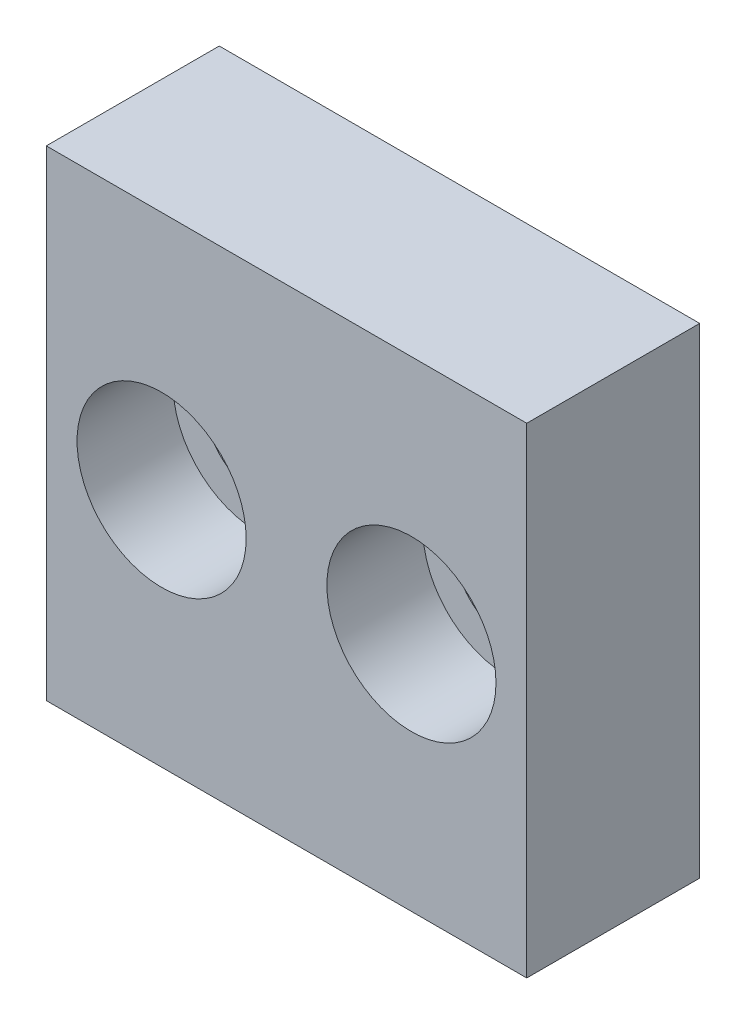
ISO-10303-21;
HEADER;
FILE_DESCRIPTION(('STEP AP214'),'2;1');
FILE_NAME('part.step','',(''),(''),'','','');
FILE_SCHEMA(('AUTOMOTIVE_DESIGN { 1 0 10303 214 1 1 1 1 }'));
ENDSEC;
DATA;
#1=APPLICATION_CONTEXT('core data for automotive mechanical design processes');
#2=APPLICATION_PROTOCOL_DEFINITION('international standard','automotive_design',2000,#1);
#3=PRODUCT_CONTEXT('',#1,'mechanical');
#4=PRODUCT('Part','Part','',(#3));
#5=PRODUCT_RELATED_PRODUCT_CATEGORY('part','',(#4));
#6=PRODUCT_DEFINITION_FORMATION('','',#4);
#7=PRODUCT_DEFINITION_CONTEXT('part definition',#1,'design');
#8=PRODUCT_DEFINITION('design','',#6,#7);
#9=PRODUCT_DEFINITION_SHAPE('','',#8);
#10=(LENGTH_UNIT() NAMED_UNIT(*) SI_UNIT(.MILLI.,.METRE.));
#11=(NAMED_UNIT(*) PLANE_ANGLE_UNIT() SI_UNIT($,.RADIAN.));
#12=(NAMED_UNIT(*) SI_UNIT($,.STERADIAN.) SOLID_ANGLE_UNIT());
#13=UNCERTAINTY_MEASURE_WITH_UNIT(LENGTH_MEASURE(1.E-05),#10,'distance_accuracy_value','');
#14=(GEOMETRIC_REPRESENTATION_CONTEXT(3) GLOBAL_UNCERTAINTY_ASSIGNED_CONTEXT((#13)) GLOBAL_UNIT_ASSIGNED_CONTEXT((#10,
#11,#12)) REPRESENTATION_CONTEXT('',''));
#15=CARTESIAN_POINT('',(0.,0.,0.));
#16=DIRECTION('',(0.,0.,1.));
#17=DIRECTION('',(1.,0.,0.));
#18=AXIS2_PLACEMENT_3D('',#15,#16,#17);
#19=CARTESIAN_POINT('',(-12.,25.,18.));
#20=DIRECTION('',(1.,0.,0.));
#21=DIRECTION('',(0.,1.,0.));
#22=AXIS2_PLACEMENT_3D('',#19,#20,#21);
#23=PLANE('',#22);
#24=DIRECTION('',(0.,-1.,0.));
#25=VECTOR('',#24,1.);
#26=CARTESIAN_POINT('',(-12.,25.,0.));
#27=LINE('',#26,#25);
#28=CARTESIAN_POINT('',(-12.,25.,0.));
#29=VERTEX_POINT('',#28);
#30=CARTESIAN_POINT('',(-12.,-25.,0.));
#31=VERTEX_POINT('',#30);
#32=EDGE_CURVE('E58',#29,#31,#27,.T.);
#33=ORIENTED_EDGE('',*,*,#32,.T.);
#34=DIRECTION('',(0.,0.,-1.));
#35=VECTOR('',#34,1.);
#36=CARTESIAN_POINT('',(-12.,-25.,18.));
#37=LINE('',#36,#35);
#38=CARTESIAN_POINT('',(-12.,-25.,18.));
#39=VERTEX_POINT('',#38);
#40=EDGE_CURVE('E9',#39,#31,#37,.T.);
#41=ORIENTED_EDGE('',*,*,#40,.F.);
#42=DIRECTION('',(0.,-1.,0.));
#43=VECTOR('',#42,1.);
#44=CARTESIAN_POINT('',(-12.,25.,18.));
#45=LINE('',#44,#43);
#46=CARTESIAN_POINT('',(-12.,25.,18.));
#47=VERTEX_POINT('',#46);
#48=EDGE_CURVE('E81',#47,#39,#45,.T.);
#49=ORIENTED_EDGE('',*,*,#48,.F.);
#50=DIRECTION('',(0.,0.,-1.));
#51=VECTOR('',#50,1.);
#52=CARTESIAN_POINT('',(-12.,25.,18.));
#53=LINE('',#52,#51);
#54=EDGE_CURVE('E70',#47,#29,#53,.T.);
#55=ORIENTED_EDGE('',*,*,#54,.T.);
#56=EDGE_LOOP('',(#33,#41,#49,#55));
#57=FACE_BOUND('',#56,.T.);
#58=ADVANCED_FACE('F14',(#57),#23,.F.);
#59=CARTESIAN_POINT('',(-12.,-25.,18.));
#60=DIRECTION('',(0.,1.,0.));
#61=DIRECTION('',(-1.,0.,0.));
#62=AXIS2_PLACEMENT_3D('',#59,#60,#61);
#63=PLANE('',#62);
#64=DIRECTION('',(1.,0.,0.));
#65=VECTOR('',#64,1.);
#66=CARTESIAN_POINT('',(-12.,-25.,0.));
#67=LINE('',#66,#65);
#68=CARTESIAN_POINT('',(38.,-25.,0.));
#69=VERTEX_POINT('',#68);
#70=EDGE_CURVE('E54',#31,#69,#67,.T.);
#71=ORIENTED_EDGE('',*,*,#70,.T.);
#72=DIRECTION('',(0.,0.,-1.));
#73=VECTOR('',#72,1.);
#74=CARTESIAN_POINT('',(38.,-25.,18.));
#75=LINE('',#74,#73);
#76=CARTESIAN_POINT('',(38.,-25.,18.));
#77=VERTEX_POINT('',#76);
#78=EDGE_CURVE('E21',#77,#69,#75,.T.);
#79=ORIENTED_EDGE('',*,*,#78,.F.);
#80=DIRECTION('',(1.,0.,0.));
#81=VECTOR('',#80,1.);
#82=CARTESIAN_POINT('',(-12.,-25.,18.));
#83=LINE('',#82,#81);
#84=EDGE_CURVE('E66',#39,#77,#83,.T.);
#85=ORIENTED_EDGE('',*,*,#84,.F.);
#86=ORIENTED_EDGE('',*,*,#40,.T.);
#87=EDGE_LOOP('',(#71,#79,#85,#86));
#88=FACE_BOUND('',#87,.T.);
#89=ADVANCED_FACE('F65',(#88),#63,.F.);
#90=CARTESIAN_POINT('',(38.,25.,18.));
#91=DIRECTION('',(-1.,0.,0.));
#92=DIRECTION('',(0.,-1.,0.));
#93=AXIS2_PLACEMENT_3D('',#90,#91,#92);
#94=PLANE('',#93);
#95=DIRECTION('',(0.,1.,0.));
#96=VECTOR('',#95,1.);
#97=CARTESIAN_POINT('',(38.,25.,0.));
#98=LINE('',#97,#96);
#99=CARTESIAN_POINT('',(38.,25.,0.));
#100=VERTEX_POINT('',#99);
#101=EDGE_CURVE('E59',#69,#100,#98,.T.);
#102=ORIENTED_EDGE('',*,*,#101,.T.);
#103=DIRECTION('',(0.,0.,-1.));
#104=VECTOR('',#103,1.);
#105=CARTESIAN_POINT('',(38.,25.,18.));
#106=LINE('',#105,#104);
#107=CARTESIAN_POINT('',(38.,25.,18.));
#108=VERTEX_POINT('',#107);
#109=EDGE_CURVE('E87',#108,#100,#106,.T.);
#110=ORIENTED_EDGE('',*,*,#109,.F.);
#111=DIRECTION('',(0.,1.,0.));
#112=VECTOR('',#111,1.);
#113=CARTESIAN_POINT('',(38.,25.,18.));
#114=LINE('',#113,#112);
#115=EDGE_CURVE('E33',#77,#108,#114,.T.);
#116=ORIENTED_EDGE('',*,*,#115,.F.);
#117=ORIENTED_EDGE('',*,*,#78,.T.);
#118=EDGE_LOOP('',(#102,#110,#116,#117));
#119=FACE_BOUND('',#118,.T.);
#120=ADVANCED_FACE('F90',(#119),#94,.F.);
#121=CARTESIAN_POINT('',(-12.,25.,18.));
#122=DIRECTION('',(0.,-1.,0.));
#123=DIRECTION('',(0.,0.,-1.));
#124=AXIS2_PLACEMENT_3D('',#121,#122,#123);
#125=PLANE('',#124);
#126=DIRECTION('',(-1.,0.,0.));
#127=VECTOR('',#126,1.);
#128=CARTESIAN_POINT('',(-12.,25.,0.));
#129=LINE('',#128,#127);
#130=EDGE_CURVE('E79',#100,#29,#129,.T.);
#131=ORIENTED_EDGE('',*,*,#130,.T.);
#132=ORIENTED_EDGE('',*,*,#54,.F.);
#133=DIRECTION('',(-1.,0.,0.));
#134=VECTOR('',#133,1.);
#135=CARTESIAN_POINT('',(-12.,25.,18.));
#136=LINE('',#135,#134);
#137=EDGE_CURVE('E28',#108,#47,#136,.T.);
#138=ORIENTED_EDGE('',*,*,#137,.F.);
#139=ORIENTED_EDGE('',*,*,#109,.T.);
#140=EDGE_LOOP('',(#131,#132,#138,#139));
#141=FACE_BOUND('',#140,.T.);
#142=ADVANCED_FACE('F92',(#141),#125,.F.);
#143=CARTESIAN_POINT('',(-12.,-25.,18.));
#144=DIRECTION('',(0.,0.,1.));
#145=DIRECTION('',(1.,0.,0.));
#146=AXIS2_PLACEMENT_3D('',#143,#144,#145);
#147=PLANE('',#146);
#148=CARTESIAN_POINT('',(26.,0.,18.));
#149=DIRECTION('',(0.,0.,1.));
#150=DIRECTION('',(1.,0.,0.));
#151=AXIS2_PLACEMENT_3D('',#148,#149,#150);
#152=CIRCLE('',#151,8.8);
#153=CARTESIAN_POINT('',(34.8,0.,18.));
#154=VERTEX_POINT('',#153);
#155=EDGE_CURVE('E222',#154,#154,#152,.T.);
#156=ORIENTED_EDGE('',*,*,#155,.F.);
#157=EDGE_LOOP('',(#156));
#158=FACE_BOUND('',#157,.T.);
#159=CARTESIAN_POINT('',(0.,0.,18.));
#160=DIRECTION('',(0.,0.,1.));
#161=DIRECTION('',(1.,0.,0.));
#162=AXIS2_PLACEMENT_3D('',#159,#160,#161);
#163=CIRCLE('',#162,8.8);
#164=CARTESIAN_POINT('',(8.79999999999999,0.,18.));
#165=VERTEX_POINT('',#164);
#166=EDGE_CURVE('E71',#165,#165,#163,.T.);
#167=ORIENTED_EDGE('',*,*,#166,.F.);
#168=EDGE_LOOP('',(#167));
#169=FACE_BOUND('',#168,.T.);
#170=ORIENTED_EDGE('',*,*,#48,.T.);
#171=ORIENTED_EDGE('',*,*,#84,.T.);
#172=ORIENTED_EDGE('',*,*,#115,.T.);
#173=ORIENTED_EDGE('',*,*,#137,.T.);
#174=EDGE_LOOP('',(#170,#171,#172,#173));
#175=FACE_BOUND('',#174,.T.);
#176=ADVANCED_FACE('F93',(#158,#169,#175),#147,.T.);
#177=CARTESIAN_POINT('',(-12.,-25.,0.));
#178=DIRECTION('',(0.,0.,1.));
#179=DIRECTION('',(1.,0.,0.));
#180=AXIS2_PLACEMENT_3D('',#177,#178,#179);
#181=PLANE('',#180);
#182=CARTESIAN_POINT('',(26.,0.,1.41425066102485E-10));
#183=DIRECTION('',(0.,0.,1.));
#184=DIRECTION('',(1.,0.,0.));
#185=AXIS2_PLACEMENT_3D('',#182,#183,#184);
#186=CIRCLE('',#185,5.5);
#187=CARTESIAN_POINT('',(31.5,0.,1.41425066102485E-10));
#188=VERTEX_POINT('',#187);
#189=EDGE_CURVE('E215',#188,#188,#186,.T.);
#190=ORIENTED_EDGE('',*,*,#189,.T.);
#191=EDGE_LOOP('',(#190));
#192=FACE_BOUND('',#191,.T.);
#193=CARTESIAN_POINT('',(0.,0.,1.41425066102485E-10));
#194=DIRECTION('',(0.,0.,1.));
#195=DIRECTION('',(1.,0.,0.));
#196=AXIS2_PLACEMENT_3D('',#193,#194,#195);
#197=CIRCLE('',#196,5.5);
#198=CARTESIAN_POINT('',(5.49999999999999,0.,1.41425066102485E-10));
#199=VERTEX_POINT('',#198);
#200=EDGE_CURVE('E228',#199,#199,#197,.T.);
#201=ORIENTED_EDGE('',*,*,#200,.T.);
#202=EDGE_LOOP('',(#201));
#203=FACE_BOUND('',#202,.T.);
#204=ORIENTED_EDGE('',*,*,#32,.F.);
#205=ORIENTED_EDGE('',*,*,#130,.F.);
#206=ORIENTED_EDGE('',*,*,#101,.F.);
#207=ORIENTED_EDGE('',*,*,#70,.F.);
#208=EDGE_LOOP('',(#204,#205,#206,#207));
#209=FACE_BOUND('',#208,.T.);
#210=ADVANCED_FACE('F55',(#192,#203,#209),#181,.F.);
#211=CARTESIAN_POINT('',(0.,0.,18.));
#212=DIRECTION('',(0.,0.,1.));
#213=DIRECTION('',(1.,0.,0.));
#214=AXIS2_PLACEMENT_3D('',#211,#212,#213);
#215=CYLINDRICAL_SURFACE('',#214,8.8);
#216=CARTESIAN_POINT('',(0.,0.,8.));
#217=DIRECTION('',(0.,0.,1.));
#218=DIRECTION('',(1.,0.,0.));
#219=AXIS2_PLACEMENT_3D('',#216,#217,#218);
#220=CIRCLE('',#219,8.8);
#221=CARTESIAN_POINT('',(8.79999999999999,0.,8.));
#222=VERTEX_POINT('',#221);
#223=EDGE_CURVE('E74',#222,#222,#220,.T.);
#224=ORIENTED_EDGE('',*,*,#223,.F.);
#225=EDGE_LOOP('',(#224));
#226=FACE_BOUND('',#225,.T.);
#227=ORIENTED_EDGE('',*,*,#166,.T.);
#228=EDGE_LOOP('',(#227));
#229=FACE_BOUND('',#228,.T.);
#230=ADVANCED_FACE('F103',(#226,#229),#215,.F.);
#231=CARTESIAN_POINT('',(5.5,0.,8.));
#232=DIRECTION('',(0.,0.,-1.));
#233=DIRECTION('',(-1.,0.,0.));
#234=AXIS2_PLACEMENT_3D('',#231,#232,#233);
#235=PLANE('',#234);
#236=CARTESIAN_POINT('',(0.,0.,8.));
#237=DIRECTION('',(0.,0.,1.));
#238=DIRECTION('',(1.,0.,0.));
#239=AXIS2_PLACEMENT_3D('',#236,#237,#238);
#240=CIRCLE('',#239,5.5);
#241=CARTESIAN_POINT('',(5.49999999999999,0.,8.));
#242=VERTEX_POINT('',#241);
#243=EDGE_CURVE('E231',#242,#242,#240,.T.);
#244=ORIENTED_EDGE('',*,*,#243,.F.);
#245=EDGE_LOOP('',(#244));
#246=FACE_BOUND('',#245,.T.);
#247=ORIENTED_EDGE('',*,*,#223,.T.);
#248=EDGE_LOOP('',(#247));
#249=FACE_BOUND('',#248,.T.);
#250=ADVANCED_FACE('F159',(#246,#249),#235,.F.);
#251=CARTESIAN_POINT('',(0.,0.,18.));
#252=DIRECTION('',(0.,0.,1.));
#253=DIRECTION('',(1.,0.,0.));
#254=AXIS2_PLACEMENT_3D('',#251,#252,#253);
#255=CYLINDRICAL_SURFACE('',#254,5.5);
#256=ORIENTED_EDGE('',*,*,#200,.F.);
#257=EDGE_LOOP('',(#256));
#258=FACE_BOUND('',#257,.T.);
#259=ORIENTED_EDGE('',*,*,#243,.T.);
#260=EDGE_LOOP('',(#259));
#261=FACE_BOUND('',#260,.T.);
#262=ADVANCED_FACE('F167',(#258,#261),#255,.F.);
#263=CARTESIAN_POINT('',(26.,0.,18.));
#264=DIRECTION('',(0.,0.,1.));
#265=DIRECTION('',(1.,0.,0.));
#266=AXIS2_PLACEMENT_3D('',#263,#264,#265);
#267=CYLINDRICAL_SURFACE('',#266,8.8);
#268=CARTESIAN_POINT('',(26.,0.,8.));
#269=DIRECTION('',(0.,0.,1.));
#270=DIRECTION('',(1.,0.,0.));
#271=AXIS2_PLACEMENT_3D('',#268,#269,#270);
#272=CIRCLE('',#271,8.8);
#273=CARTESIAN_POINT('',(34.8,0.,8.));
#274=VERTEX_POINT('',#273);
#275=EDGE_CURVE('E219',#274,#274,#272,.T.);
#276=ORIENTED_EDGE('',*,*,#275,.F.);
#277=EDGE_LOOP('',(#276));
#278=FACE_BOUND('',#277,.T.);
#279=ORIENTED_EDGE('',*,*,#155,.T.);
#280=EDGE_LOOP('',(#279));
#281=FACE_BOUND('',#280,.T.);
#282=ADVANCED_FACE('F176',(#278,#281),#267,.F.);
#283=CARTESIAN_POINT('',(31.5,0.,8.));
#284=DIRECTION('',(0.,0.,-1.));
#285=DIRECTION('',(-1.,0.,0.));
#286=AXIS2_PLACEMENT_3D('',#283,#284,#285);
#287=PLANE('',#286);
#288=CARTESIAN_POINT('',(26.,0.,8.));
#289=DIRECTION('',(0.,0.,1.));
#290=DIRECTION('',(1.,0.,0.));
#291=AXIS2_PLACEMENT_3D('',#288,#289,#290);
#292=CIRCLE('',#291,5.5);
#293=CARTESIAN_POINT('',(31.5,0.,8.));
#294=VERTEX_POINT('',#293);
#295=EDGE_CURVE('E218',#294,#294,#292,.T.);
#296=ORIENTED_EDGE('',*,*,#295,.F.);
#297=EDGE_LOOP('',(#296));
#298=FACE_BOUND('',#297,.T.);
#299=ORIENTED_EDGE('',*,*,#275,.T.);
#300=EDGE_LOOP('',(#299));
#301=FACE_BOUND('',#300,.T.);
#302=ADVANCED_FACE('F185',(#298,#301),#287,.F.);
#303=CARTESIAN_POINT('',(26.,0.,18.));
#304=DIRECTION('',(0.,0.,1.));
#305=DIRECTION('',(1.,0.,0.));
#306=AXIS2_PLACEMENT_3D('',#303,#304,#305);
#307=CYLINDRICAL_SURFACE('',#306,5.5);
#308=ORIENTED_EDGE('',*,*,#189,.F.);
#309=EDGE_LOOP('',(#308));
#310=FACE_BOUND('',#309,.T.);
#311=ORIENTED_EDGE('',*,*,#295,.T.);
#312=EDGE_LOOP('',(#311));
#313=FACE_BOUND('',#312,.T.);
#314=ADVANCED_FACE('F194',(#310,#313),#307,.F.);
#315=CLOSED_SHELL('',(#58,#89,#120,#142,#176,#210,#230,#250,#262,#282,#302,#314));
#316=MANIFOLD_SOLID_BREP('B1',#315);
#317=ADVANCED_BREP_SHAPE_REPRESENTATION('',(#18,#316),#14);
#318=SHAPE_DEFINITION_REPRESENTATION(#9,#317);
ENDSEC;
END-ISO-10303-21;
